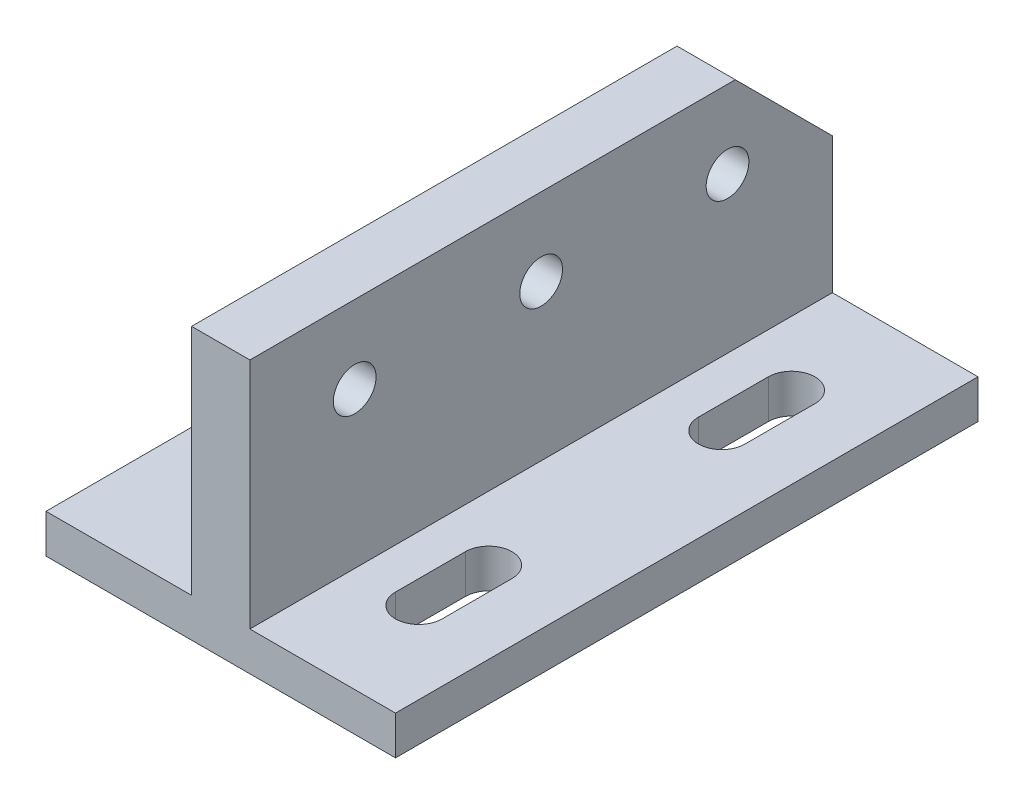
from build123d import *

# Parameters (mm, degrees)
BOSS_EXTRUDE1_DEPTH        = 75
CUT_EXTRUDE1_DEPTH         = 84.852549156
F_5_5_5_5_DIAMETER_HOLE1_D = 5.5
CHAMFER1_SIZE              = 12.5


with BuildPart() as part:
    # Sketch1 → Boss-Extrude1 (new body)
    with BuildSketch(Plane.XY):
        Polygon((-22.5, 0), (22.5, 0), (22.5, 5), (3.75, 5), (3.75, 35), (-3.75, 35), (-3.75, 5), (-22.5, 5), align=None)
    extrude(amount=-BOSS_EXTRUDE1_DEPTH)

    # Sketch3 → Cut-Extrude1 (cut, through all)
    with BuildSketch(Plane(origin=(0, 5, 0), x_dir=(1, 0, 0), z_dir=(0, 1, 0))):
        with BuildLine():
            Line((15, 22.5), (15, 13.5))
            ThreePointArc((15, 13.5), (12, 10.5), (9, 13.5))
            Line((9, 13.5), (9, 22.5))
            ThreePointArc((9, 22.5), (12, 25.5), (15, 22.5))
        make_face()
        with BuildLine():
            Line((-15, 22.5), (-15, 13.5))
            ThreePointArc((-15, 13.5), (-12, 10.5), (-9, 13.5))
            Line((-9, 13.5), (-9, 22.5))
            ThreePointArc((-9, 22.5), (-12, 25.5), (-15, 22.5))
        make_face()
        with BuildLine():
            Line((-15, 52.5), (-15, 61.5))
            ThreePointArc((-15, 61.5), (-12, 64.5), (-9, 61.5))
            Line((-9, 61.5), (-9, 52.5))
            ThreePointArc((-9, 52.5), (-12, 49.5), (-15, 52.5))
        make_face()
        with BuildLine():
            Line((15, 52.5), (15, 61.5))
            ThreePointArc((15, 61.5), (12, 64.5), (9, 61.5))
            Line((9, 61.5), (9, 52.5))
            ThreePointArc((9, 52.5), (12, 49.5), (15, 52.5))
        make_face()
    extrude(amount=-CUT_EXTRUDE1_DEPTH, mode=Mode.SUBTRACT)

    # 5.5 _5.5_ Diameter Hole1 (through all)
    with Locations(Plane(origin=(3.75, 0, 0), x_dir=(0, 0, -1), z_dir=(1, 0, 0))):
        with Locations((61.5, 25), (37.5, 25), (13.5, 25)):
            Hole(F_5_5_5_5_DIAMETER_HOLE1_D / 2)

    # Chamfer1
    chamfer1_edges = [part.edges().sort_by_distance(p)[0] for p in [
        (0, 35, -75),
    ]]
    chamfer(chamfer1_edges, length=CHAMFER1_SIZE)


solid = part.part
